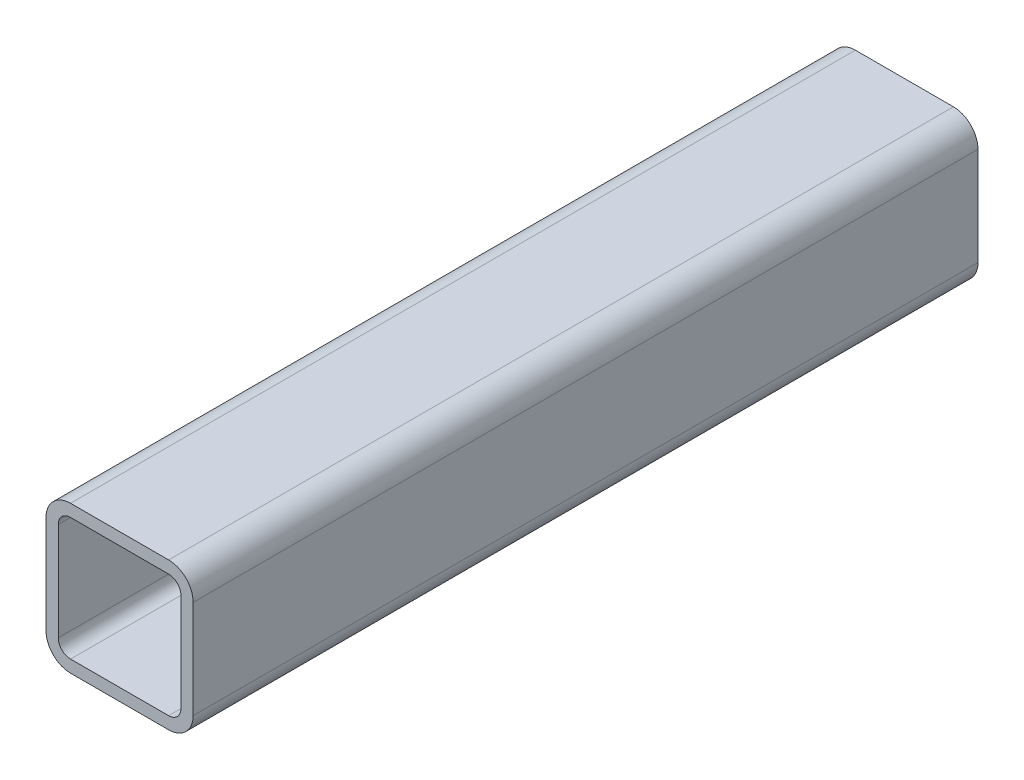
ISO-10303-21;
HEADER;
FILE_DESCRIPTION(('STEP AP214'),'2;1');
FILE_NAME('part.step','',(''),(''),'','','');
FILE_SCHEMA(('AUTOMOTIVE_DESIGN { 1 0 10303 214 1 1 1 1 }'));
ENDSEC;
DATA;
#1=APPLICATION_CONTEXT('core data for automotive mechanical design processes');
#2=APPLICATION_PROTOCOL_DEFINITION('international standard','automotive_design',2000,#1);
#3=PRODUCT_CONTEXT('',#1,'mechanical');
#4=PRODUCT('Part','Part','',(#3));
#5=PRODUCT_RELATED_PRODUCT_CATEGORY('part','',(#4));
#6=PRODUCT_DEFINITION_FORMATION('','',#4);
#7=PRODUCT_DEFINITION_CONTEXT('part definition',#1,'design');
#8=PRODUCT_DEFINITION('design','',#6,#7);
#9=PRODUCT_DEFINITION_SHAPE('','',#8);
#10=(LENGTH_UNIT() NAMED_UNIT(*) SI_UNIT(.MILLI.,.METRE.));
#11=(NAMED_UNIT(*) PLANE_ANGLE_UNIT() SI_UNIT($,.RADIAN.));
#12=(NAMED_UNIT(*) SI_UNIT($,.STERADIAN.) SOLID_ANGLE_UNIT());
#13=UNCERTAINTY_MEASURE_WITH_UNIT(LENGTH_MEASURE(1.E-05),#10,'distance_accuracy_value','');
#14=(GEOMETRIC_REPRESENTATION_CONTEXT(3) GLOBAL_UNCERTAINTY_ASSIGNED_CONTEXT((#13)) GLOBAL_UNIT_ASSIGNED_CONTEXT((#10,
#11,#12)) REPRESENTATION_CONTEXT('',''));
#15=CARTESIAN_POINT('',(0.,0.,0.));
#16=DIRECTION('',(0.,0.,1.));
#17=DIRECTION('',(1.,0.,0.));
#18=AXIS2_PLACEMENT_3D('',#15,#16,#17);
#19=CARTESIAN_POINT('',(9.65305425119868,49.0890005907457,304.8));
#20=DIRECTION('',(0.,0.,1.));
#21=DIRECTION('',(1.,0.,0.));
#22=AXIS2_PLACEMENT_3D('',#19,#20,#21);
#23=PLANE('',#22);
#24=CARTESIAN_POINT('',(9.65305425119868,49.0890005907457,304.8));
#25=DIRECTION('',(0.,0.,1.));
#26=DIRECTION('',(1.,0.,0.));
#27=AXIS2_PLACEMENT_3D('',#24,#25,#26);
#28=CIRCLE('',#27,9.525);
#29=CARTESIAN_POINT('',(9.65305425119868,58.6140005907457,304.8));
#30=VERTEX_POINT('',#29);
#31=CARTESIAN_POINT('',(0.128054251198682,49.0890005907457,304.8));
#32=VERTEX_POINT('',#31);
#33=EDGE_CURVE('E211',#30,#32,#28,.T.);
#34=ORIENTED_EDGE('',*,*,#33,.T.);
#35=DIRECTION('',(0.,-1.,0.));
#36=VECTOR('',#35,1.);
#37=CARTESIAN_POINT('',(0.128054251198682,10.9890005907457,304.8));
#38=LINE('',#37,#36);
#39=CARTESIAN_POINT('',(0.128054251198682,10.9890005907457,304.8));
#40=VERTEX_POINT('',#39);
#41=EDGE_CURVE('E214',#32,#40,#38,.T.);
#42=ORIENTED_EDGE('',*,*,#41,.T.);
#43=CARTESIAN_POINT('',(9.65305425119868,10.9890005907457,304.8));
#44=DIRECTION('',(0.,0.,1.));
#45=DIRECTION('',(1.,0.,0.));
#46=AXIS2_PLACEMENT_3D('',#43,#44,#45);
#47=CIRCLE('',#46,9.525);
#48=CARTESIAN_POINT('',(9.65305425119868,1.46400059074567,304.8));
#49=VERTEX_POINT('',#48);
#50=EDGE_CURVE('E217',#40,#49,#47,.T.);
#51=ORIENTED_EDGE('',*,*,#50,.T.);
#52=DIRECTION('',(1.,0.,0.));
#53=VECTOR('',#52,1.);
#54=CARTESIAN_POINT('',(47.7530542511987,1.46400059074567,304.8));
#55=LINE('',#54,#53);
#56=CARTESIAN_POINT('',(47.7530542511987,1.46400059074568,304.8));
#57=VERTEX_POINT('',#56);
#58=EDGE_CURVE('E219',#49,#57,#55,.T.);
#59=ORIENTED_EDGE('',*,*,#58,.T.);
#60=CARTESIAN_POINT('',(47.7530542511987,10.9890005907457,304.8));
#61=DIRECTION('',(0.,0.,1.));
#62=DIRECTION('',(1.,0.,0.));
#63=AXIS2_PLACEMENT_3D('',#60,#61,#62);
#64=CIRCLE('',#63,9.525);
#65=CARTESIAN_POINT('',(57.2780542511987,10.9890005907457,304.8));
#66=VERTEX_POINT('',#65);
#67=EDGE_CURVE('E221',#57,#66,#64,.T.);
#68=ORIENTED_EDGE('',*,*,#67,.T.);
#69=DIRECTION('',(0.,1.,0.));
#70=VECTOR('',#69,1.);
#71=CARTESIAN_POINT('',(57.2780542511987,49.0890005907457,304.8));
#72=LINE('',#71,#70);
#73=CARTESIAN_POINT('',(57.2780542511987,49.0890005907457,304.8));
#74=VERTEX_POINT('',#73);
#75=EDGE_CURVE('E223',#66,#74,#72,.T.);
#76=ORIENTED_EDGE('',*,*,#75,.T.);
#77=CARTESIAN_POINT('',(47.7530542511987,49.0890005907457,304.8));
#78=DIRECTION('',(0.,0.,1.));
#79=DIRECTION('',(1.,0.,0.));
#80=AXIS2_PLACEMENT_3D('',#77,#78,#79);
#81=CIRCLE('',#80,9.52499999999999);
#82=CARTESIAN_POINT('',(47.7530542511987,58.6140005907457,304.8));
#83=VERTEX_POINT('',#82);
#84=EDGE_CURVE('E225',#74,#83,#81,.T.);
#85=ORIENTED_EDGE('',*,*,#84,.T.);
#86=DIRECTION('',(-1.,0.,0.));
#87=VECTOR('',#86,1.);
#88=CARTESIAN_POINT('',(9.65305425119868,58.6140005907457,304.8));
#89=LINE('',#88,#87);
#90=EDGE_CURVE('E227',#83,#30,#89,.T.);
#91=ORIENTED_EDGE('',*,*,#90,.T.);
#92=EDGE_LOOP('',(#34,#42,#51,#59,#68,#76,#85,#91));
#93=FACE_BOUND('',#92,.T.);
#94=DIRECTION('',(0.,-1.,0.));
#95=VECTOR('',#94,1.);
#96=CARTESIAN_POINT('',(4.89055425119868,10.9890005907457,304.8));
#97=LINE('',#96,#95);
#98=CARTESIAN_POINT('',(4.89055425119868,49.0890005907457,304.8));
#99=VERTEX_POINT('',#98);
#100=CARTESIAN_POINT('',(4.89055425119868,10.9890005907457,304.8));
#101=VERTEX_POINT('',#100);
#102=EDGE_CURVE('E154',#99,#101,#97,.T.);
#103=ORIENTED_EDGE('',*,*,#102,.F.);
#104=CARTESIAN_POINT('',(9.65305425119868,49.0890005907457,304.8));
#105=DIRECTION('',(0.,0.,1.));
#106=DIRECTION('',(1.,0.,0.));
#107=AXIS2_PLACEMENT_3D('',#104,#105,#106);
#108=CIRCLE('',#107,4.7625);
#109=CARTESIAN_POINT('',(9.65305425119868,53.8515005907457,304.8));
#110=VERTEX_POINT('',#109);
#111=EDGE_CURVE('E146',#110,#99,#108,.T.);
#112=ORIENTED_EDGE('',*,*,#111,.F.);
#113=DIRECTION('',(-1.,0.,0.));
#114=VECTOR('',#113,1.);
#115=CARTESIAN_POINT('',(9.65305425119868,53.8515005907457,304.8));
#116=LINE('',#115,#114);
#117=CARTESIAN_POINT('',(47.7530542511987,53.8515005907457,304.8));
#118=VERTEX_POINT('',#117);
#119=EDGE_CURVE('E179',#118,#110,#116,.T.);
#120=ORIENTED_EDGE('',*,*,#119,.F.);
#121=CARTESIAN_POINT('',(47.7530542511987,49.0890005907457,304.8));
#122=DIRECTION('',(0.,0.,1.));
#123=DIRECTION('',(1.,0.,0.));
#124=AXIS2_PLACEMENT_3D('',#121,#122,#123);
#125=CIRCLE('',#124,4.7625);
#126=CARTESIAN_POINT('',(52.5155542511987,49.0890005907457,304.8));
#127=VERTEX_POINT('',#126);
#128=EDGE_CURVE('E177',#127,#118,#125,.T.);
#129=ORIENTED_EDGE('',*,*,#128,.F.);
#130=DIRECTION('',(0.,1.,0.));
#131=VECTOR('',#130,1.);
#132=CARTESIAN_POINT('',(52.5155542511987,49.0890005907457,304.8));
#133=LINE('',#132,#131);
#134=CARTESIAN_POINT('',(52.5155542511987,10.9890005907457,304.8));
#135=VERTEX_POINT('',#134);
#136=EDGE_CURVE('E175',#135,#127,#133,.T.);
#137=ORIENTED_EDGE('',*,*,#136,.F.);
#138=CARTESIAN_POINT('',(47.7530542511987,10.9890005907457,304.8));
#139=DIRECTION('',(0.,0.,1.));
#140=DIRECTION('',(1.,0.,0.));
#141=AXIS2_PLACEMENT_3D('',#138,#139,#140);
#142=CIRCLE('',#141,4.7625);
#143=CARTESIAN_POINT('',(47.7530542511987,6.22650059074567,304.8));
#144=VERTEX_POINT('',#143);
#145=EDGE_CURVE('E173',#144,#135,#142,.T.);
#146=ORIENTED_EDGE('',*,*,#145,.F.);
#147=DIRECTION('',(1.,0.,0.));
#148=VECTOR('',#147,1.);
#149=CARTESIAN_POINT('',(47.7530542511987,6.22650059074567,304.8));
#150=LINE('',#149,#148);
#151=CARTESIAN_POINT('',(9.65305425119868,6.22650059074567,304.8));
#152=VERTEX_POINT('',#151);
#153=EDGE_CURVE('E169',#152,#144,#150,.T.);
#154=ORIENTED_EDGE('',*,*,#153,.F.);
#155=CARTESIAN_POINT('',(9.65305425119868,10.9890005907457,304.8));
#156=DIRECTION('',(0.,0.,1.));
#157=DIRECTION('',(1.,0.,0.));
#158=AXIS2_PLACEMENT_3D('',#155,#156,#157);
#159=CIRCLE('',#158,4.7625);
#160=EDGE_CURVE('E167',#101,#152,#159,.T.);
#161=ORIENTED_EDGE('',*,*,#160,.F.);
#162=EDGE_LOOP('',(#103,#112,#120,#129,#137,#146,#154,#161));
#163=FACE_BOUND('',#162,.T.);
#164=ADVANCED_FACE('F33',(#93,#163),#23,.T.);
#165=CARTESIAN_POINT('',(9.65305425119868,49.0890005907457,0.));
#166=DIRECTION('',(0.,0.,1.));
#167=DIRECTION('',(1.,0.,0.));
#168=AXIS2_PLACEMENT_3D('',#165,#166,#167);
#169=PLANE('',#168);
#170=CARTESIAN_POINT('',(9.65305425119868,49.0890005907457,0.));
#171=DIRECTION('',(0.,0.,1.));
#172=DIRECTION('',(1.,0.,0.));
#173=AXIS2_PLACEMENT_3D('',#170,#171,#172);
#174=CIRCLE('',#173,9.525);
#175=CARTESIAN_POINT('',(9.65305425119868,58.6140005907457,0.));
#176=VERTEX_POINT('',#175);
#177=CARTESIAN_POINT('',(0.128054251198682,49.0890005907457,0.));
#178=VERTEX_POINT('',#177);
#179=EDGE_CURVE('E162',#176,#178,#174,.T.);
#180=ORIENTED_EDGE('',*,*,#179,.F.);
#181=DIRECTION('',(-1.,0.,0.));
#182=VECTOR('',#181,1.);
#183=CARTESIAN_POINT('',(9.65305425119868,58.6140005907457,0.));
#184=LINE('',#183,#182);
#185=CARTESIAN_POINT('',(47.7530542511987,58.6140005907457,0.));
#186=VERTEX_POINT('',#185);
#187=EDGE_CURVE('E215',#186,#176,#184,.T.);
#188=ORIENTED_EDGE('',*,*,#187,.F.);
#189=CARTESIAN_POINT('',(47.7530542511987,49.0890005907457,0.));
#190=DIRECTION('',(0.,0.,1.));
#191=DIRECTION('',(1.,0.,0.));
#192=AXIS2_PLACEMENT_3D('',#189,#190,#191);
#193=CIRCLE('',#192,9.52499999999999);
#194=CARTESIAN_POINT('',(57.2780542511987,49.0890005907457,0.));
#195=VERTEX_POINT('',#194);
#196=EDGE_CURVE('E242',#195,#186,#193,.T.);
#197=ORIENTED_EDGE('',*,*,#196,.F.);
#198=DIRECTION('',(0.,1.,0.));
#199=VECTOR('',#198,1.);
#200=CARTESIAN_POINT('',(57.2780542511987,49.0890005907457,0.));
#201=LINE('',#200,#199);
#202=CARTESIAN_POINT('',(57.2780542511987,10.9890005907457,0.));
#203=VERTEX_POINT('',#202);
#204=EDGE_CURVE('E240',#203,#195,#201,.T.);
#205=ORIENTED_EDGE('',*,*,#204,.F.);
#206=CARTESIAN_POINT('',(47.7530542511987,10.9890005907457,0.));
#207=DIRECTION('',(0.,0.,1.));
#208=DIRECTION('',(1.,0.,0.));
#209=AXIS2_PLACEMENT_3D('',#206,#207,#208);
#210=CIRCLE('',#209,9.525);
#211=CARTESIAN_POINT('',(47.7530542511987,1.46400059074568,0.));
#212=VERTEX_POINT('',#211);
#213=EDGE_CURVE('E238',#212,#203,#210,.T.);
#214=ORIENTED_EDGE('',*,*,#213,.F.);
#215=DIRECTION('',(1.,0.,0.));
#216=VECTOR('',#215,1.);
#217=CARTESIAN_POINT('',(47.7530542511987,1.46400059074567,0.));
#218=LINE('',#217,#216);
#219=CARTESIAN_POINT('',(9.65305425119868,1.46400059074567,0.));
#220=VERTEX_POINT('',#219);
#221=EDGE_CURVE('E236',#220,#212,#218,.T.);
#222=ORIENTED_EDGE('',*,*,#221,.F.);
#223=CARTESIAN_POINT('',(9.65305425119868,10.9890005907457,0.));
#224=DIRECTION('',(0.,0.,1.));
#225=DIRECTION('',(1.,0.,0.));
#226=AXIS2_PLACEMENT_3D('',#223,#224,#225);
#227=CIRCLE('',#226,9.525);
#228=CARTESIAN_POINT('',(0.128054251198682,10.9890005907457,0.));
#229=VERTEX_POINT('',#228);
#230=EDGE_CURVE('E234',#229,#220,#227,.T.);
#231=ORIENTED_EDGE('',*,*,#230,.F.);
#232=DIRECTION('',(0.,-1.,0.));
#233=VECTOR('',#232,1.);
#234=CARTESIAN_POINT('',(0.128054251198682,10.9890005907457,0.));
#235=LINE('',#234,#233);
#236=EDGE_CURVE('E232',#178,#229,#235,.T.);
#237=ORIENTED_EDGE('',*,*,#236,.F.);
#238=EDGE_LOOP('',(#180,#188,#197,#205,#214,#222,#231,#237));
#239=FACE_BOUND('',#238,.T.);
#240=CARTESIAN_POINT('',(9.65305425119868,49.0890005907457,0.));
#241=DIRECTION('',(0.,0.,1.));
#242=DIRECTION('',(1.,0.,0.));
#243=AXIS2_PLACEMENT_3D('',#240,#241,#242);
#244=CIRCLE('',#243,4.7625);
#245=CARTESIAN_POINT('',(9.65305425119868,53.8515005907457,0.));
#246=VERTEX_POINT('',#245);
#247=CARTESIAN_POINT('',(4.89055425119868,49.0890005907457,0.));
#248=VERTEX_POINT('',#247);
#249=EDGE_CURVE('E56',#246,#248,#244,.T.);
#250=ORIENTED_EDGE('',*,*,#249,.T.);
#251=DIRECTION('',(0.,-1.,0.));
#252=VECTOR('',#251,1.);
#253=CARTESIAN_POINT('',(4.89055425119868,10.9890005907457,0.));
#254=LINE('',#253,#252);
#255=CARTESIAN_POINT('',(4.89055425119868,10.9890005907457,0.));
#256=VERTEX_POINT('',#255);
#257=EDGE_CURVE('E161',#248,#256,#254,.T.);
#258=ORIENTED_EDGE('',*,*,#257,.T.);
#259=CARTESIAN_POINT('',(9.65305425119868,10.9890005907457,0.));
#260=DIRECTION('',(0.,0.,1.));
#261=DIRECTION('',(1.,0.,0.));
#262=AXIS2_PLACEMENT_3D('',#259,#260,#261);
#263=CIRCLE('',#262,4.7625);
#264=CARTESIAN_POINT('',(9.65305425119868,6.22650059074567,0.));
#265=VERTEX_POINT('',#264);
#266=EDGE_CURVE('E183',#256,#265,#263,.T.);
#267=ORIENTED_EDGE('',*,*,#266,.T.);
#268=DIRECTION('',(1.,0.,0.));
#269=VECTOR('',#268,1.);
#270=CARTESIAN_POINT('',(47.7530542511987,6.22650059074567,0.));
#271=LINE('',#270,#269);
#272=CARTESIAN_POINT('',(47.7530542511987,6.22650059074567,0.));
#273=VERTEX_POINT('',#272);
#274=EDGE_CURVE('E186',#265,#273,#271,.T.);
#275=ORIENTED_EDGE('',*,*,#274,.T.);
#276=CARTESIAN_POINT('',(47.7530542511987,10.9890005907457,0.));
#277=DIRECTION('',(0.,0.,1.));
#278=DIRECTION('',(1.,0.,0.));
#279=AXIS2_PLACEMENT_3D('',#276,#277,#278);
#280=CIRCLE('',#279,4.7625);
#281=CARTESIAN_POINT('',(52.5155542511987,10.9890005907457,0.));
#282=VERTEX_POINT('',#281);
#283=EDGE_CURVE('E189',#273,#282,#280,.T.);
#284=ORIENTED_EDGE('',*,*,#283,.T.);
#285=DIRECTION('',(0.,1.,0.));
#286=VECTOR('',#285,1.);
#287=CARTESIAN_POINT('',(52.5155542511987,49.0890005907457,0.));
#288=LINE('',#287,#286);
#289=CARTESIAN_POINT('',(52.5155542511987,49.0890005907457,0.));
#290=VERTEX_POINT('',#289);
#291=EDGE_CURVE('E192',#282,#290,#288,.T.);
#292=ORIENTED_EDGE('',*,*,#291,.T.);
#293=CARTESIAN_POINT('',(47.7530542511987,49.0890005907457,0.));
#294=DIRECTION('',(0.,0.,1.));
#295=DIRECTION('',(1.,0.,0.));
#296=AXIS2_PLACEMENT_3D('',#293,#294,#295);
#297=CIRCLE('',#296,4.7625);
#298=CARTESIAN_POINT('',(47.7530542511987,53.8515005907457,0.));
#299=VERTEX_POINT('',#298);
#300=EDGE_CURVE('E195',#290,#299,#297,.T.);
#301=ORIENTED_EDGE('',*,*,#300,.T.);
#302=DIRECTION('',(-1.,0.,0.));
#303=VECTOR('',#302,1.);
#304=CARTESIAN_POINT('',(9.65305425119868,53.8515005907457,0.));
#305=LINE('',#304,#303);
#306=EDGE_CURVE('E155',#299,#246,#305,.T.);
#307=ORIENTED_EDGE('',*,*,#306,.T.);
#308=EDGE_LOOP('',(#250,#258,#267,#275,#284,#292,#301,#307));
#309=FACE_BOUND('',#308,.T.);
#310=ADVANCED_FACE('F272',(#239,#309),#169,.F.);
#311=CARTESIAN_POINT('',(9.65305425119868,49.0890005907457,304.8));
#312=DIRECTION('',(0.,0.,-1.));
#313=DIRECTION('',(-1.,0.,0.));
#314=AXIS2_PLACEMENT_3D('',#311,#312,#313);
#315=CYLINDRICAL_SURFACE('',#314,9.525);
#316=ORIENTED_EDGE('',*,*,#179,.T.);
#317=DIRECTION('',(0.,0.,-1.));
#318=VECTOR('',#317,1.);
#319=CARTESIAN_POINT('',(0.128054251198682,49.0890005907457,304.8));
#320=LINE('',#319,#318);
#321=EDGE_CURVE('E11',#32,#178,#320,.T.);
#322=ORIENTED_EDGE('',*,*,#321,.F.);
#323=ORIENTED_EDGE('',*,*,#33,.F.);
#324=DIRECTION('',(0.,0.,-1.));
#325=VECTOR('',#324,1.);
#326=CARTESIAN_POINT('',(9.65305425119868,58.6140005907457,304.8));
#327=LINE('',#326,#325);
#328=EDGE_CURVE('E229',#30,#176,#327,.T.);
#329=ORIENTED_EDGE('',*,*,#328,.T.);
#330=EDGE_LOOP('',(#316,#322,#323,#329));
#331=FACE_BOUND('',#330,.T.);
#332=ADVANCED_FACE('F35',(#331),#315,.T.);
#333=CARTESIAN_POINT('',(0.128054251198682,10.9890005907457,304.8));
#334=DIRECTION('',(1.,0.,0.));
#335=DIRECTION('',(0.,0.,-1.));
#336=AXIS2_PLACEMENT_3D('',#333,#334,#335);
#337=PLANE('',#336);
#338=ORIENTED_EDGE('',*,*,#236,.T.);
#339=DIRECTION('',(0.,0.,-1.));
#340=VECTOR('',#339,1.);
#341=CARTESIAN_POINT('',(0.128054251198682,10.9890005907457,304.8));
#342=LINE('',#341,#340);
#343=EDGE_CURVE('E41',#40,#229,#342,.T.);
#344=ORIENTED_EDGE('',*,*,#343,.F.);
#345=ORIENTED_EDGE('',*,*,#41,.F.);
#346=ORIENTED_EDGE('',*,*,#321,.T.);
#347=EDGE_LOOP('',(#338,#344,#345,#346));
#348=FACE_BOUND('',#347,.T.);
#349=ADVANCED_FACE('F289',(#348),#337,.F.);
#350=CARTESIAN_POINT('',(9.65305425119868,10.9890005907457,304.8));
#351=DIRECTION('',(0.,0.,-1.));
#352=DIRECTION('',(-1.,0.,0.));
#353=AXIS2_PLACEMENT_3D('',#350,#351,#352);
#354=CYLINDRICAL_SURFACE('',#353,9.525);
#355=ORIENTED_EDGE('',*,*,#230,.T.);
#356=DIRECTION('',(0.,0.,-1.));
#357=VECTOR('',#356,1.);
#358=CARTESIAN_POINT('',(9.65305425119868,1.46400059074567,304.8));
#359=LINE('',#358,#357);
#360=EDGE_CURVE('E259',#49,#220,#359,.T.);
#361=ORIENTED_EDGE('',*,*,#360,.F.);
#362=ORIENTED_EDGE('',*,*,#50,.F.);
#363=ORIENTED_EDGE('',*,*,#343,.T.);
#364=EDGE_LOOP('',(#355,#361,#362,#363));
#365=FACE_BOUND('',#364,.T.);
#366=ADVANCED_FACE('F266',(#365),#354,.T.);
#367=CARTESIAN_POINT('',(47.7530542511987,1.46400059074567,304.8));
#368=DIRECTION('',(0.,1.,0.));
#369=DIRECTION('',(0.,0.,1.));
#370=AXIS2_PLACEMENT_3D('',#367,#368,#369);
#371=PLANE('',#370);
#372=ORIENTED_EDGE('',*,*,#221,.T.);
#373=DIRECTION('',(0.,0.,-1.));
#374=VECTOR('',#373,1.);
#375=CARTESIAN_POINT('',(47.7530542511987,1.46400059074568,304.8));
#376=LINE('',#375,#374);
#377=EDGE_CURVE('E256',#57,#212,#376,.T.);
#378=ORIENTED_EDGE('',*,*,#377,.F.);
#379=ORIENTED_EDGE('',*,*,#58,.F.);
#380=ORIENTED_EDGE('',*,*,#360,.T.);
#381=EDGE_LOOP('',(#372,#378,#379,#380));
#382=FACE_BOUND('',#381,.T.);
#383=ADVANCED_FACE('F278',(#382),#371,.F.);
#384=CARTESIAN_POINT('',(47.7530542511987,10.9890005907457,304.8));
#385=DIRECTION('',(0.,0.,-1.));
#386=DIRECTION('',(-1.,0.,0.));
#387=AXIS2_PLACEMENT_3D('',#384,#385,#386);
#388=CYLINDRICAL_SURFACE('',#387,9.525);
#389=ORIENTED_EDGE('',*,*,#213,.T.);
#390=DIRECTION('',(0.,0.,-1.));
#391=VECTOR('',#390,1.);
#392=CARTESIAN_POINT('',(57.2780542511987,10.9890005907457,304.8));
#393=LINE('',#392,#391);
#394=EDGE_CURVE('E253',#66,#203,#393,.T.);
#395=ORIENTED_EDGE('',*,*,#394,.F.);
#396=ORIENTED_EDGE('',*,*,#67,.F.);
#397=ORIENTED_EDGE('',*,*,#377,.T.);
#398=EDGE_LOOP('',(#389,#395,#396,#397));
#399=FACE_BOUND('',#398,.T.);
#400=ADVANCED_FACE('F282',(#399),#388,.T.);
#401=CARTESIAN_POINT('',(57.2780542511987,49.0890005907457,304.8));
#402=DIRECTION('',(-1.,0.,0.));
#403=DIRECTION('',(0.,0.,1.));
#404=AXIS2_PLACEMENT_3D('',#401,#402,#403);
#405=PLANE('',#404);
#406=ORIENTED_EDGE('',*,*,#204,.T.);
#407=DIRECTION('',(0.,0.,-1.));
#408=VECTOR('',#407,1.);
#409=CARTESIAN_POINT('',(57.2780542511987,49.0890005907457,304.8));
#410=LINE('',#409,#408);
#411=EDGE_CURVE('E250',#74,#195,#410,.T.);
#412=ORIENTED_EDGE('',*,*,#411,.F.);
#413=ORIENTED_EDGE('',*,*,#75,.F.);
#414=ORIENTED_EDGE('',*,*,#394,.T.);
#415=EDGE_LOOP('',(#406,#412,#413,#414));
#416=FACE_BOUND('',#415,.T.);
#417=ADVANCED_FACE('F302',(#416),#405,.F.);
#418=CARTESIAN_POINT('',(47.7530542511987,49.0890005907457,304.8));
#419=DIRECTION('',(0.,0.,-1.));
#420=DIRECTION('',(-1.,0.,0.));
#421=AXIS2_PLACEMENT_3D('',#418,#419,#420);
#422=CYLINDRICAL_SURFACE('',#421,9.52499999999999);
#423=ORIENTED_EDGE('',*,*,#196,.T.);
#424=DIRECTION('',(0.,0.,-1.));
#425=VECTOR('',#424,1.);
#426=CARTESIAN_POINT('',(47.7530542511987,58.6140005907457,304.8));
#427=LINE('',#426,#425);
#428=EDGE_CURVE('E247',#83,#186,#427,.T.);
#429=ORIENTED_EDGE('',*,*,#428,.F.);
#430=ORIENTED_EDGE('',*,*,#84,.F.);
#431=ORIENTED_EDGE('',*,*,#411,.T.);
#432=EDGE_LOOP('',(#423,#429,#430,#431));
#433=FACE_BOUND('',#432,.T.);
#434=ADVANCED_FACE('F300',(#433),#422,.T.);
#435=CARTESIAN_POINT('',(9.65305425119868,58.6140005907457,304.8));
#436=DIRECTION('',(0.,-1.,0.));
#437=DIRECTION('',(0.,0.,-1.));
#438=AXIS2_PLACEMENT_3D('',#435,#436,#437);
#439=PLANE('',#438);
#440=ORIENTED_EDGE('',*,*,#187,.T.);
#441=ORIENTED_EDGE('',*,*,#328,.F.);
#442=ORIENTED_EDGE('',*,*,#90,.F.);
#443=ORIENTED_EDGE('',*,*,#428,.T.);
#444=EDGE_LOOP('',(#440,#441,#442,#443));
#445=FACE_BOUND('',#444,.T.);
#446=ADVANCED_FACE('F295',(#445),#439,.F.);
#447=CARTESIAN_POINT('',(9.65305425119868,49.0890005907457,304.8));
#448=DIRECTION('',(0.,0.,-1.));
#449=DIRECTION('',(-1.,0.,0.));
#450=AXIS2_PLACEMENT_3D('',#447,#448,#449);
#451=CYLINDRICAL_SURFACE('',#450,4.7625);
#452=ORIENTED_EDGE('',*,*,#249,.F.);
#453=DIRECTION('',(0.,0.,-1.));
#454=VECTOR('',#453,1.);
#455=CARTESIAN_POINT('',(9.65305425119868,53.8515005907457,304.8));
#456=LINE('',#455,#454);
#457=EDGE_CURVE('E150',#110,#246,#456,.T.);
#458=ORIENTED_EDGE('',*,*,#457,.F.);
#459=ORIENTED_EDGE('',*,*,#111,.T.);
#460=DIRECTION('',(0.,0.,-1.));
#461=VECTOR('',#460,1.);
#462=CARTESIAN_POINT('',(4.89055425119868,49.0890005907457,304.8));
#463=LINE('',#462,#461);
#464=EDGE_CURVE('E149',#99,#248,#463,.T.);
#465=ORIENTED_EDGE('',*,*,#464,.T.);
#466=EDGE_LOOP('',(#452,#458,#459,#465));
#467=FACE_BOUND('',#466,.T.);
#468=ADVANCED_FACE('F148',(#467),#451,.F.);
#469=CARTESIAN_POINT('',(4.89055425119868,10.9890005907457,304.8));
#470=DIRECTION('',(1.,0.,0.));
#471=DIRECTION('',(0.,0.,-1.));
#472=AXIS2_PLACEMENT_3D('',#469,#470,#471);
#473=PLANE('',#472);
#474=ORIENTED_EDGE('',*,*,#257,.F.);
#475=ORIENTED_EDGE('',*,*,#464,.F.);
#476=ORIENTED_EDGE('',*,*,#102,.T.);
#477=DIRECTION('',(0.,0.,-1.));
#478=VECTOR('',#477,1.);
#479=CARTESIAN_POINT('',(4.89055425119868,10.9890005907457,304.8));
#480=LINE('',#479,#478);
#481=EDGE_CURVE('E163',#101,#256,#480,.T.);
#482=ORIENTED_EDGE('',*,*,#481,.T.);
#483=EDGE_LOOP('',(#474,#475,#476,#482));
#484=FACE_BOUND('',#483,.T.);
#485=ADVANCED_FACE('F158',(#484),#473,.T.);
#486=CARTESIAN_POINT('',(9.65305425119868,10.9890005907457,304.8));
#487=DIRECTION('',(0.,0.,-1.));
#488=DIRECTION('',(-1.,0.,0.));
#489=AXIS2_PLACEMENT_3D('',#486,#487,#488);
#490=CYLINDRICAL_SURFACE('',#489,4.7625);
#491=ORIENTED_EDGE('',*,*,#266,.F.);
#492=ORIENTED_EDGE('',*,*,#481,.F.);
#493=ORIENTED_EDGE('',*,*,#160,.T.);
#494=DIRECTION('',(0.,0.,-1.));
#495=VECTOR('',#494,1.);
#496=CARTESIAN_POINT('',(9.65305425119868,6.22650059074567,304.8));
#497=LINE('',#496,#495);
#498=EDGE_CURVE('E208',#152,#265,#497,.T.);
#499=ORIENTED_EDGE('',*,*,#498,.T.);
#500=EDGE_LOOP('',(#491,#492,#493,#499));
#501=FACE_BOUND('',#500,.T.);
#502=ADVANCED_FACE('F327',(#501),#490,.F.);
#503=CARTESIAN_POINT('',(47.7530542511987,6.22650059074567,304.8));
#504=DIRECTION('',(0.,1.,0.));
#505=DIRECTION('',(0.,0.,1.));
#506=AXIS2_PLACEMENT_3D('',#503,#504,#505);
#507=PLANE('',#506);
#508=ORIENTED_EDGE('',*,*,#274,.F.);
#509=ORIENTED_EDGE('',*,*,#498,.F.);
#510=ORIENTED_EDGE('',*,*,#153,.T.);
#511=DIRECTION('',(0.,0.,-1.));
#512=VECTOR('',#511,1.);
#513=CARTESIAN_POINT('',(47.7530542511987,6.22650059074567,304.8));
#514=LINE('',#513,#512);
#515=EDGE_CURVE('E206',#144,#273,#514,.T.);
#516=ORIENTED_EDGE('',*,*,#515,.T.);
#517=EDGE_LOOP('',(#508,#509,#510,#516));
#518=FACE_BOUND('',#517,.T.);
#519=ADVANCED_FACE('F331',(#518),#507,.T.);
#520=CARTESIAN_POINT('',(47.7530542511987,10.9890005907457,304.8));
#521=DIRECTION('',(0.,0.,-1.));
#522=DIRECTION('',(-1.,0.,0.));
#523=AXIS2_PLACEMENT_3D('',#520,#521,#522);
#524=CYLINDRICAL_SURFACE('',#523,4.7625);
#525=ORIENTED_EDGE('',*,*,#283,.F.);
#526=ORIENTED_EDGE('',*,*,#515,.F.);
#527=ORIENTED_EDGE('',*,*,#145,.T.);
#528=DIRECTION('',(0.,0.,-1.));
#529=VECTOR('',#528,1.);
#530=CARTESIAN_POINT('',(52.5155542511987,10.9890005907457,304.8));
#531=LINE('',#530,#529);
#532=EDGE_CURVE('E204',#135,#282,#531,.T.);
#533=ORIENTED_EDGE('',*,*,#532,.T.);
#534=EDGE_LOOP('',(#525,#526,#527,#533));
#535=FACE_BOUND('',#534,.T.);
#536=ADVANCED_FACE('F337',(#535),#524,.F.);
#537=CARTESIAN_POINT('',(52.5155542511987,49.0890005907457,304.8));
#538=DIRECTION('',(-1.,0.,0.));
#539=DIRECTION('',(0.,0.,1.));
#540=AXIS2_PLACEMENT_3D('',#537,#538,#539);
#541=PLANE('',#540);
#542=ORIENTED_EDGE('',*,*,#291,.F.);
#543=ORIENTED_EDGE('',*,*,#532,.F.);
#544=ORIENTED_EDGE('',*,*,#136,.T.);
#545=DIRECTION('',(0.,0.,-1.));
#546=VECTOR('',#545,1.);
#547=CARTESIAN_POINT('',(52.5155542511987,49.0890005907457,304.8));
#548=LINE('',#547,#546);
#549=EDGE_CURVE('E202',#127,#290,#548,.T.);
#550=ORIENTED_EDGE('',*,*,#549,.T.);
#551=EDGE_LOOP('',(#542,#543,#544,#550));
#552=FACE_BOUND('',#551,.T.);
#553=ADVANCED_FACE('F341',(#552),#541,.T.);
#554=CARTESIAN_POINT('',(47.7530542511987,49.0890005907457,304.8));
#555=DIRECTION('',(0.,0.,-1.));
#556=DIRECTION('',(-1.,0.,0.));
#557=AXIS2_PLACEMENT_3D('',#554,#555,#556);
#558=CYLINDRICAL_SURFACE('',#557,4.7625);
#559=ORIENTED_EDGE('',*,*,#300,.F.);
#560=ORIENTED_EDGE('',*,*,#549,.F.);
#561=ORIENTED_EDGE('',*,*,#128,.T.);
#562=DIRECTION('',(0.,0.,-1.));
#563=VECTOR('',#562,1.);
#564=CARTESIAN_POINT('',(47.7530542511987,53.8515005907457,304.8));
#565=LINE('',#564,#563);
#566=EDGE_CURVE('E48',#118,#299,#565,.T.);
#567=ORIENTED_EDGE('',*,*,#566,.T.);
#568=EDGE_LOOP('',(#559,#560,#561,#567));
#569=FACE_BOUND('',#568,.T.);
#570=ADVANCED_FACE('F345',(#569),#558,.F.);
#571=CARTESIAN_POINT('',(9.65305425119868,53.8515005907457,304.8));
#572=DIRECTION('',(0.,-1.,0.));
#573=DIRECTION('',(0.,0.,-1.));
#574=AXIS2_PLACEMENT_3D('',#571,#572,#573);
#575=PLANE('',#574);
#576=ORIENTED_EDGE('',*,*,#306,.F.);
#577=ORIENTED_EDGE('',*,*,#566,.F.);
#578=ORIENTED_EDGE('',*,*,#119,.T.);
#579=ORIENTED_EDGE('',*,*,#457,.T.);
#580=EDGE_LOOP('',(#576,#577,#578,#579));
#581=FACE_BOUND('',#580,.T.);
#582=ADVANCED_FACE('F349',(#581),#575,.T.);
#583=CLOSED_SHELL('',(#164,#310,#332,#349,#366,#383,#400,#417,#434,#446,#468,#485,#502,#519,
#536,#553,#570,#582));
#584=MANIFOLD_SOLID_BREP('B2',#583);
#585=ADVANCED_BREP_SHAPE_REPRESENTATION('',(#18,#584),#14);
#586=SHAPE_DEFINITION_REPRESENTATION(#9,#585);
ENDSEC;
END-ISO-10303-21;
